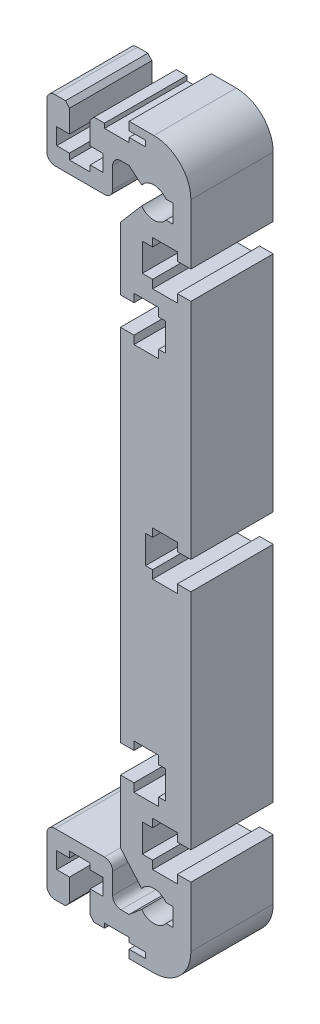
from build123d import *

# Parameters (mm, degrees)
AUFSATZ_LINEAR_AUSTRAGEN1_DEPTH = 10


with BuildPart() as part:
    # Skizze1 → Aufsatz-Linear austragen1 (new body)
    with BuildSketch(Plane.XY):
        with BuildLine():
            Line((0, -32.900769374), (0, -25.25))
            Line((0, -25.25), (1.647941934, -25.25))
            Line((1.647941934, -25.25), (1.647941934, -26.25))
            Line((1.647941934, -26.25), (4.647941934, -26.25))
            Line((4.647941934, -26.25), (4.647941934, -25.25))
            Line((4.647941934, -25.25), (5.497941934, -25.25))
            Line((5.497941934, -25.25), (5.497941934, -21.85))
            Line((5.497941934, -21.85), (4.647941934, -21.85))
            Line((4.647941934, -21.85), (4.647941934, -20.85))
            Line((4.647941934, -20.85), (1.647941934, -20.85))
            Line((1.647941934, -20.85), (1.647941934, -21.85))
            Line((1.647941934, -21.85), (0, -21.85))
            Line((0, -21.85), (0, 0))
            Line((0, 0), (3.057941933, 0))
            Line((3.057941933, 0), (3.057941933, -1.7))
            Line((3.057941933, -1.7), (3.90794193, -1.7))
            Line((3.90794193, -1.7), (3.90794193, -2.7))
            Line((3.90794193, -2.7), (6.90794193, -2.7))
            Line((6.90794193, -2.7), (6.90794193, -1.7))
            Line((6.90794193, -1.7), (8.557941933, -1.7))
            Line((8.557941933, -1.7), (8.557941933, -28.85))
            Line((8.557941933, -28.85), (6.907941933, -28.85))
            Line((6.907941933, -28.85), (6.907941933, -27.85))
            Line((6.907941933, -27.85), (3.907941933, -27.85))
            Line((3.907941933, -27.85), (3.907941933, -28.85))
            Line((3.907941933, -28.85), (2.657941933, -28.85))
            Line((2.657941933, -28.85), (2.657941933, -32.25))
            Line((2.657941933, -32.25), (3.907941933, -32.25))
            Line((3.907941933, -32.25), (3.907941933, -33.25))
            Line((3.907941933, -33.25), (6.907941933, -33.25))
            Line((6.907941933, -33.25), (6.907941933, -32.25))
            Line((6.907941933, -32.25), (8.557941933, -32.25))
            Line((8.557941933, -32.25), (8.557941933, -39.55))
            ThreePointArc((8.557941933, -39.55), (7.239922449, -42.731980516), (4.057941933, -44.05))
            Line((4.057941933, -44.05), (1.057941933, -44.05))
            Line((1.057941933, -44.05), (1.057941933, -43.05))
            Line((1.057941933, -43.05), (3.057941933, -43.05))
            Line((3.057941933, -43.05), (3.057941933, -42.35))
            Line((3.057941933, -42.35), (1.057941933, -42.35))
            Line((1.057941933, -42.35), (1.057941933, -41.8))
            Line((1.057941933, -41.8), (-1.942058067, -41.8))
            Line((-1.942058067, -41.8), (-1.942058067, -42.35))
            Line((-1.942058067, -42.35), (-3.211048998, -42.35))
            Line((-3.211048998, -42.35), (-3.69, -41.8))
            Line((-3.69, -41.8), (-3.69, -39.08))
            Line((-3.69, -39.08), (-2.14, -39.08))
            Line((-2.14, -39.08), (-2.14, -37.08))
            Line((-2.14, -37.08), (-3.69, -37.08))
            Line((-3.69, -37.08), (-3.69, -36.35))
            Line((-3.69, -36.35), (-6.19, -36.35))
            Line((-6.19, -36.35), (-6.19, -37.08))
            Line((-6.19, -37.08), (-7.74, -37.08))
            Line((-7.74, -37.08), (-7.74, -39.08))
            Line((-7.74, -39.08), (-6.19, -39.08))
            Line((-6.19, -39.08), (-6.19, -41.8))
            Line((-6.19, -41.8), (-6.668951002, -42.35))
            Line((-6.668951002, -42.35), (-7.942058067, -42.35))
            ThreePointArc((-7.942058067, -42.35), (-8.649164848, -42.057106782), (-8.942058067, -41.35))
            Line((-8.942058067, -41.35), (-8.942058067, -35.85))
            ThreePointArc((-8.942058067, -35.85), (-8.649164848, -35.142893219), (-7.942058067, -34.85))
            Line((-7.942058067, -34.85), (-1.942058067, -34.85))
            ThreePointArc((-1.942058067, -34.85), (-1.234951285, -35.142893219), (-0.942058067, -35.85))
            Line((-0.942058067, -35.85), (-0.942058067, -38.4))
            ThreePointArc((-0.942058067, -38.4), (-0.649164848, -39.107106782), (0.057941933, -39.4))
            Line((0.057941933, -39.4), (1.056937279, -39.4))
            Line((1.056937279, -39.4), (2.572552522, -38.1))
            ThreePointArc((2.572552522, -38.1), (4.06, -38.85), (5.547447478, -38.1))
            Line((5.547447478, -38.1), (6.41, -38.1))
            Line((6.41, -38.1), (6.41, -35.9))
            Line((6.41, -35.9), (5.547447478, -35.9))
            ThreePointArc((5.547447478, -35.9), (4.06, -35.15), (2.572552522, -35.9))
            Line((2.572552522, -35.9), (0, -32.900769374))
        make_face()
    extrude(amount=AUFSATZ_LINEAR_AUSTRAGEN1_DEPTH)

    # Spiegeln1: part across plane


with BuildPart() as part_1:
    add(part.part)
    add(part.part.mirror(Plane(origin=(3.057941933, 0, 10), x_dir=(0, 0, 1), z_dir=(0, -1, 0))))


solid = part_1.part
